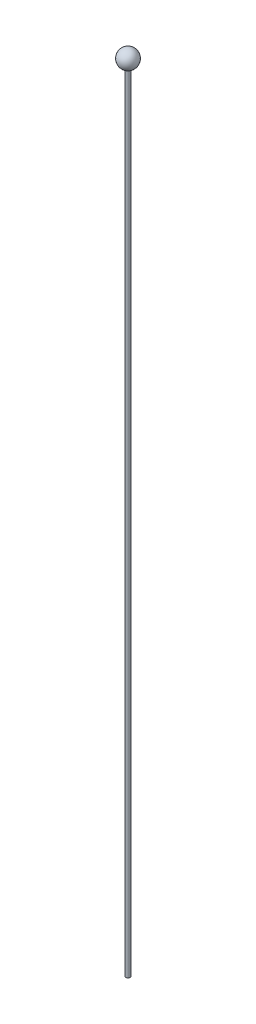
from build123d import *


with BuildPart() as part:
    # Sketch1 → Revolve1 (revolve)
    with BuildSketch(Plane.XY, mode=Mode.PRIVATE) as revolve1_sk:
        with BuildLine():
            Line((0, 0), (0, 90))
            Line((0, 90), (0, 91))
            ThreePointArc((0, 91), (0.992029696, 90.126004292), (0.25, 89.031754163))
            Line((0.25, 89.031754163), (0.25, 0))
            Line((0.25, 0), (0, 0))
        make_face()
    revolve(revolve1_sk.sketch.rotate(Axis((0, 0, 0), (0, 1, 0)), 90), axis=Axis((0, 0, 0), (0, 1, 0)))


solid = part.part
